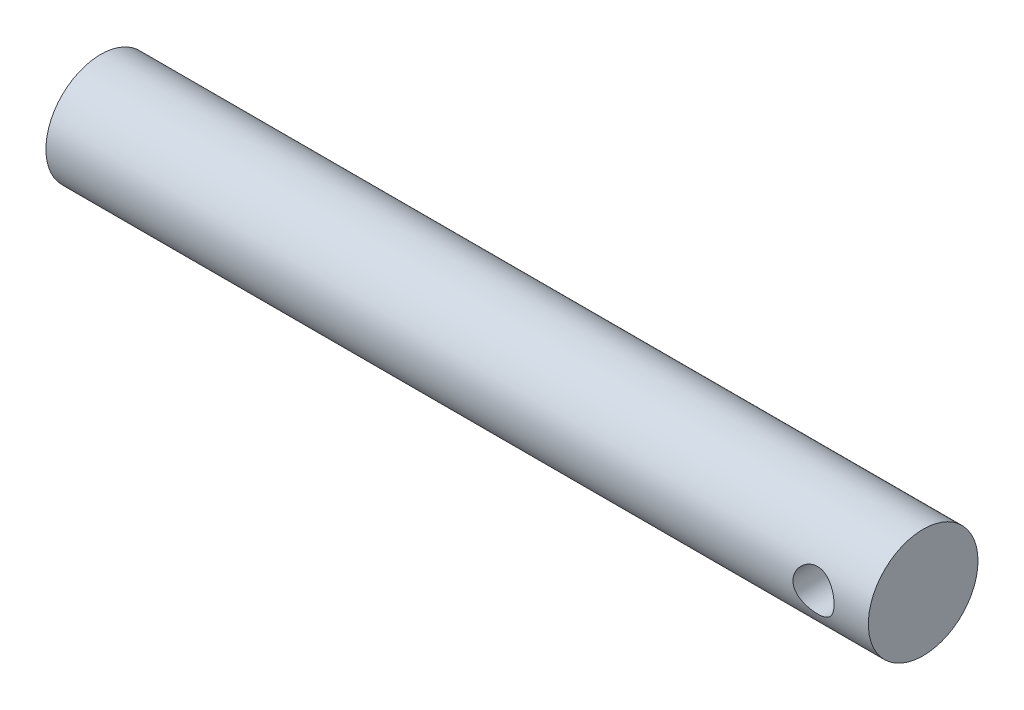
from build123d import *

# Parameters (mm, degrees)
SKETCH1_R               = 6.35
BASE_EXTRUDE_DEPTH      = 95.25
CUT_EXTRUDE1_DEPTH      = 96.672396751
CUT_EXTRUDE1_DEPTH_BACK = 96.672396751
SKETCH2_R               = 2.38125


with BuildPart() as part:
    # Sketch1 → Base-Extrude (new body)
    with BuildSketch(Plane(origin=(0, 0, 0), x_dir=(0, 0, -1), z_dir=(1, 0, 0))):
        Circle(SKETCH1_R)
    extrude(amount=BASE_EXTRUDE_DEPTH)

    # Sketch2 → Cut-Extrude1 (cut, two sides: drawn at the far end of the back side and taken through both)
    with BuildSketch(Plane.XY.offset(-CUT_EXTRUDE1_DEPTH_BACK)):
        with Locations((88.9, 0)):
            Circle(SKETCH2_R)
    extrude(amount=CUT_EXTRUDE1_DEPTH + CUT_EXTRUDE1_DEPTH_BACK, mode=Mode.SUBTRACT)


solid = part.part
